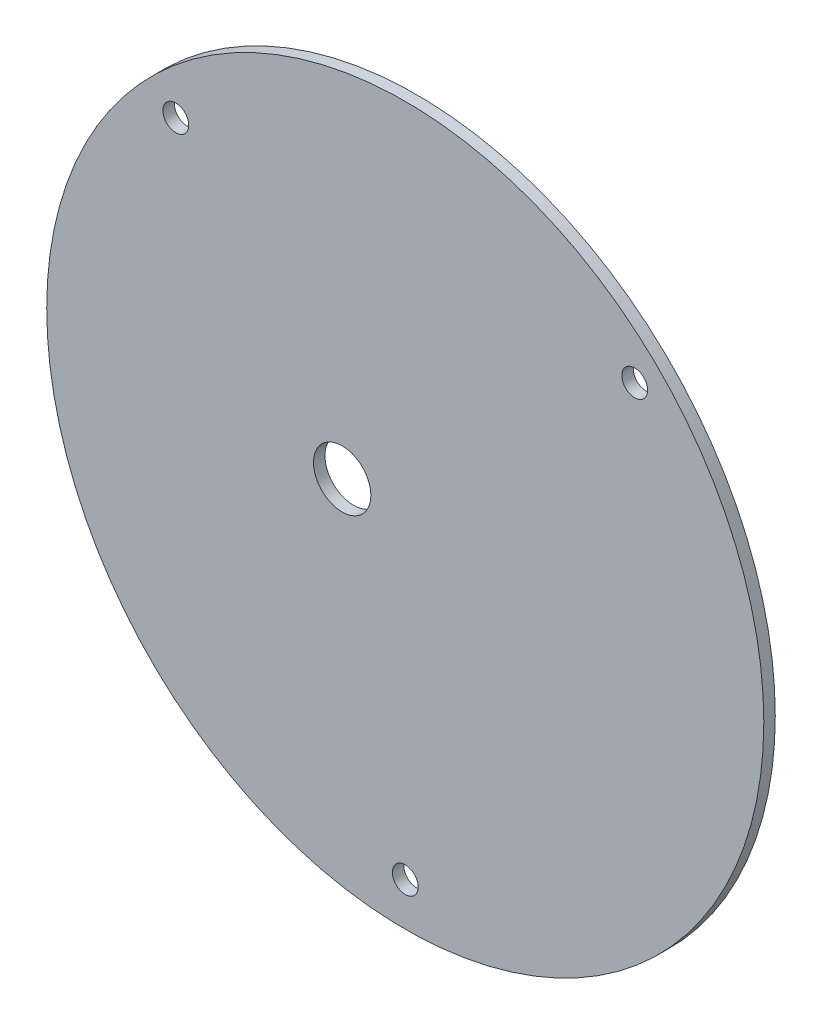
ISO-10303-21;
HEADER;
FILE_DESCRIPTION(('STEP AP214'),'2;1');
FILE_NAME('part.step','',(''),(''),'','','');
FILE_SCHEMA(('AUTOMOTIVE_DESIGN { 1 0 10303 214 1 1 1 1 }'));
ENDSEC;
DATA;
#1=APPLICATION_CONTEXT('core data for automotive mechanical design processes');
#2=APPLICATION_PROTOCOL_DEFINITION('international standard','automotive_design',2000,#1);
#3=PRODUCT_CONTEXT('',#1,'mechanical');
#4=PRODUCT('Part','Part','',(#3));
#5=PRODUCT_RELATED_PRODUCT_CATEGORY('part','',(#4));
#6=PRODUCT_DEFINITION_FORMATION('','',#4);
#7=PRODUCT_DEFINITION_CONTEXT('part definition',#1,'design');
#8=PRODUCT_DEFINITION('design','',#6,#7);
#9=PRODUCT_DEFINITION_SHAPE('','',#8);
#10=(LENGTH_UNIT() NAMED_UNIT(*) SI_UNIT(.MILLI.,.METRE.));
#11=(NAMED_UNIT(*) PLANE_ANGLE_UNIT() SI_UNIT($,.RADIAN.));
#12=(NAMED_UNIT(*) SI_UNIT($,.STERADIAN.) SOLID_ANGLE_UNIT());
#13=UNCERTAINTY_MEASURE_WITH_UNIT(LENGTH_MEASURE(1.E-05),#10,'distance_accuracy_value','');
#14=(GEOMETRIC_REPRESENTATION_CONTEXT(3) GLOBAL_UNCERTAINTY_ASSIGNED_CONTEXT((#13)) GLOBAL_UNIT_ASSIGNED_CONTEXT((#10,
#11,#12)) REPRESENTATION_CONTEXT('',''));
#15=CARTESIAN_POINT('',(0.,0.,0.));
#16=DIRECTION('',(0.,0.,1.));
#17=DIRECTION('',(1.,0.,0.));
#18=AXIS2_PLACEMENT_3D('',#15,#16,#17);
#19=CARTESIAN_POINT('',(0.,-2.22044604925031E-13,4.00000000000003));
#20=DIRECTION('',(0.,0.,1.));
#21=DIRECTION('',(0.999999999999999,0.,0.));
#22=AXIS2_PLACEMENT_3D('',#19,#20,#21);
#23=PLANE('',#22);
#24=CARTESIAN_POINT('',(0.,-110.,3.99999999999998));
#25=DIRECTION('',(0.,0.,1.));
#26=DIRECTION('',(0.999999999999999,0.,0.));
#27=AXIS2_PLACEMENT_3D('',#24,#25,#26);
#28=CIRCLE('',#27,4.5);
#29=CARTESIAN_POINT('',(4.49999999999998,-110.,3.99999999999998));
#30=VERTEX_POINT('',#29);
#31=EDGE_CURVE('E50',#30,#30,#28,.T.);
#32=ORIENTED_EDGE('',*,*,#31,.F.);
#33=EDGE_LOOP('',(#32));
#34=FACE_BOUND('',#33,.T.);
#35=CARTESIAN_POINT('',(80.,80.0000000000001,4.00000000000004));
#36=DIRECTION('',(0.,0.,1.));
#37=DIRECTION('',(0.999999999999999,0.,0.));
#38=AXIS2_PLACEMENT_3D('',#35,#36,#37);
#39=CIRCLE('',#38,4.50000000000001);
#40=CARTESIAN_POINT('',(84.5,80.0000000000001,4.00000000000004));
#41=VERTEX_POINT('',#40);
#42=EDGE_CURVE('E39',#41,#41,#39,.T.);
#43=ORIENTED_EDGE('',*,*,#42,.F.);
#44=EDGE_LOOP('',(#43));
#45=FACE_BOUND('',#44,.T.);
#46=CARTESIAN_POINT('',(0.,-2.22044604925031E-13,4.00000000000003));
#47=DIRECTION('',(0.,0.,1.));
#48=DIRECTION('',(0.999999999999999,0.,0.));
#49=AXIS2_PLACEMENT_3D('',#46,#47,#48);
#50=CIRCLE('',#49,125.);
#51=CARTESIAN_POINT('',(125.,-2.32452945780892E-13,4.00000000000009));
#52=VERTEX_POINT('',#51);
#53=EDGE_CURVE('E10',#52,#52,#50,.T.);
#54=ORIENTED_EDGE('',*,*,#53,.T.);
#55=EDGE_LOOP('',(#54));
#56=FACE_BOUND('',#55,.T.);
#57=CARTESIAN_POINT('',(-79.9999999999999,79.9999999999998,3.99999999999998));
#58=DIRECTION('',(0.,0.,1.));
#59=DIRECTION('',(0.999999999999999,0.,0.));
#60=AXIS2_PLACEMENT_3D('',#57,#58,#59);
#61=CIRCLE('',#60,4.50000000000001);
#62=CARTESIAN_POINT('',(-75.4999999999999,79.9999999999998,3.99999999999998));
#63=VERTEX_POINT('',#62);
#64=EDGE_CURVE('E44',#63,#63,#61,.T.);
#65=ORIENTED_EDGE('',*,*,#64,.F.);
#66=EDGE_LOOP('',(#65));
#67=FACE_BOUND('',#66,.T.);
#68=CARTESIAN_POINT('',(-22.,0.,4.00000000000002));
#69=DIRECTION('',(0.,0.,1.));
#70=DIRECTION('',(0.999999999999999,0.,0.));
#71=AXIS2_PLACEMENT_3D('',#68,#69,#70);
#72=CIRCLE('',#71,10.);
#73=CARTESIAN_POINT('',(-12.,0.,4.00000000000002));
#74=VERTEX_POINT('',#73);
#75=EDGE_CURVE('E56',#74,#74,#72,.T.);
#76=ORIENTED_EDGE('',*,*,#75,.F.);
#77=EDGE_LOOP('',(#76));
#78=FACE_BOUND('',#77,.T.);
#79=ADVANCED_FACE('F28',(#34,#45,#56,#67,#78),#23,.T.);
#80=CARTESIAN_POINT('',(0.,0.,0.));
#81=DIRECTION('',(0.,0.,1.));
#82=DIRECTION('',(0.999999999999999,0.,0.));
#83=AXIS2_PLACEMENT_3D('',#80,#81,#82);
#84=PLANE('',#83);
#85=CARTESIAN_POINT('',(0.,0.,0.));
#86=DIRECTION('',(0.,0.,1.));
#87=DIRECTION('',(0.999999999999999,0.,0.));
#88=AXIS2_PLACEMENT_3D('',#85,#86,#87);
#89=CIRCLE('',#88,125.);
#90=CARTESIAN_POINT('',(125.,0.,0.));
#91=VERTEX_POINT('',#90);
#92=EDGE_CURVE('E32',#91,#91,#89,.T.);
#93=ORIENTED_EDGE('',*,*,#92,.F.);
#94=EDGE_LOOP('',(#93));
#95=FACE_BOUND('',#94,.T.);
#96=CARTESIAN_POINT('',(79.9999999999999,79.9999999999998,0.));
#97=DIRECTION('',(0.,0.,1.));
#98=DIRECTION('',(0.999999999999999,0.,0.));
#99=AXIS2_PLACEMENT_3D('',#96,#97,#98);
#100=CIRCLE('',#99,4.50000000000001);
#101=CARTESIAN_POINT('',(84.4999999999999,79.9999999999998,0.));
#102=VERTEX_POINT('',#101);
#103=EDGE_CURVE('E41',#102,#102,#100,.T.);
#104=ORIENTED_EDGE('',*,*,#103,.T.);
#105=EDGE_LOOP('',(#104));
#106=FACE_BOUND('',#105,.T.);
#107=CARTESIAN_POINT('',(-79.9999999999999,80.0000000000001,0.));
#108=DIRECTION('',(0.,0.,1.));
#109=DIRECTION('',(0.999999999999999,0.,0.));
#110=AXIS2_PLACEMENT_3D('',#107,#108,#109);
#111=CIRCLE('',#110,4.50000000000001);
#112=CARTESIAN_POINT('',(-75.4999999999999,80.0000000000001,0.));
#113=VERTEX_POINT('',#112);
#114=EDGE_CURVE('E47',#113,#113,#111,.T.);
#115=ORIENTED_EDGE('',*,*,#114,.T.);
#116=EDGE_LOOP('',(#115));
#117=FACE_BOUND('',#116,.T.);
#118=CARTESIAN_POINT('',(0.,-110.,0.));
#119=DIRECTION('',(0.,0.,1.));
#120=DIRECTION('',(0.999999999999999,0.,0.));
#121=AXIS2_PLACEMENT_3D('',#118,#119,#120);
#122=CIRCLE('',#121,4.5);
#123=CARTESIAN_POINT('',(4.50000000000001,-110.,0.));
#124=VERTEX_POINT('',#123);
#125=EDGE_CURVE('E53',#124,#124,#122,.T.);
#126=ORIENTED_EDGE('',*,*,#125,.T.);
#127=EDGE_LOOP('',(#126));
#128=FACE_BOUND('',#127,.T.);
#129=CARTESIAN_POINT('',(-22.,0.,0.));
#130=DIRECTION('',(0.,0.,1.));
#131=DIRECTION('',(0.999999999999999,0.,0.));
#132=AXIS2_PLACEMENT_3D('',#129,#130,#131);
#133=CIRCLE('',#132,10.);
#134=CARTESIAN_POINT('',(-12.,0.,0.));
#135=VERTEX_POINT('',#134);
#136=EDGE_CURVE('E59',#135,#135,#133,.T.);
#137=ORIENTED_EDGE('',*,*,#136,.T.);
#138=EDGE_LOOP('',(#137));
#139=FACE_BOUND('',#138,.T.);
#140=ADVANCED_FACE('F69',(#95,#106,#117,#128,#139),#84,.F.);
#141=CARTESIAN_POINT('',(0.,-2.22044604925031E-13,4.00000000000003));
#142=DIRECTION('',(0.,0.,-1.));
#143=DIRECTION('',(-0.999999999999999,0.,0.));
#144=AXIS2_PLACEMENT_3D('',#141,#142,#143);
#145=CYLINDRICAL_SURFACE('',#144,125.);
#146=ORIENTED_EDGE('',*,*,#53,.F.);
#147=EDGE_LOOP('',(#146));
#148=FACE_BOUND('',#147,.T.);
#149=ORIENTED_EDGE('',*,*,#92,.T.);
#150=EDGE_LOOP('',(#149));
#151=FACE_BOUND('',#150,.T.);
#152=ADVANCED_FACE('F30',(#148,#151),#145,.T.);
#153=CARTESIAN_POINT('',(80.,80.0000000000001,4.00000000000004));
#154=DIRECTION('',(0.,0.,-1.));
#155=DIRECTION('',(-0.999999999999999,0.,0.));
#156=AXIS2_PLACEMENT_3D('',#153,#154,#155);
#157=CYLINDRICAL_SURFACE('',#156,4.50000000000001);
#158=ORIENTED_EDGE('',*,*,#42,.T.);
#159=EDGE_LOOP('',(#158));
#160=FACE_BOUND('',#159,.T.);
#161=ORIENTED_EDGE('',*,*,#103,.F.);
#162=EDGE_LOOP('',(#161));
#163=FACE_BOUND('',#162,.T.);
#164=ADVANCED_FACE('F79',(#160,#163),#157,.F.);
#165=CARTESIAN_POINT('',(-79.9999999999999,79.9999999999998,3.99999999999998));
#166=DIRECTION('',(0.,0.,-1.));
#167=DIRECTION('',(-0.999999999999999,0.,0.));
#168=AXIS2_PLACEMENT_3D('',#165,#166,#167);
#169=CYLINDRICAL_SURFACE('',#168,4.50000000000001);
#170=ORIENTED_EDGE('',*,*,#64,.T.);
#171=EDGE_LOOP('',(#170));
#172=FACE_BOUND('',#171,.T.);
#173=ORIENTED_EDGE('',*,*,#114,.F.);
#174=EDGE_LOOP('',(#173));
#175=FACE_BOUND('',#174,.T.);
#176=ADVANCED_FACE('F82',(#172,#175),#169,.F.);
#177=CARTESIAN_POINT('',(0.,-110.,3.99999999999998));
#178=DIRECTION('',(0.,0.,-1.));
#179=DIRECTION('',(-0.999999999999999,0.,0.));
#180=AXIS2_PLACEMENT_3D('',#177,#178,#179);
#181=CYLINDRICAL_SURFACE('',#180,4.5);
#182=ORIENTED_EDGE('',*,*,#31,.T.);
#183=EDGE_LOOP('',(#182));
#184=FACE_BOUND('',#183,.T.);
#185=ORIENTED_EDGE('',*,*,#125,.F.);
#186=EDGE_LOOP('',(#185));
#187=FACE_BOUND('',#186,.T.);
#188=ADVANCED_FACE('F86',(#184,#187),#181,.F.);
#189=CARTESIAN_POINT('',(-22.,0.,4.00000000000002));
#190=DIRECTION('',(0.,0.,-1.));
#191=DIRECTION('',(-0.999999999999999,0.,0.));
#192=AXIS2_PLACEMENT_3D('',#189,#190,#191);
#193=CYLINDRICAL_SURFACE('',#192,10.);
#194=ORIENTED_EDGE('',*,*,#75,.T.);
#195=EDGE_LOOP('',(#194));
#196=FACE_BOUND('',#195,.T.);
#197=ORIENTED_EDGE('',*,*,#136,.F.);
#198=EDGE_LOOP('',(#197));
#199=FACE_BOUND('',#198,.T.);
#200=ADVANCED_FACE('F65',(#196,#199),#193,.F.);
#201=CLOSED_SHELL('',(#79,#140,#152,#164,#176,#188,#200));
#202=MANIFOLD_SOLID_BREP('B2',#201);
#203=ADVANCED_BREP_SHAPE_REPRESENTATION('',(#18,#202),#14);
#204=SHAPE_DEFINITION_REPRESENTATION(#9,#203);
ENDSEC;
END-ISO-10303-21;
